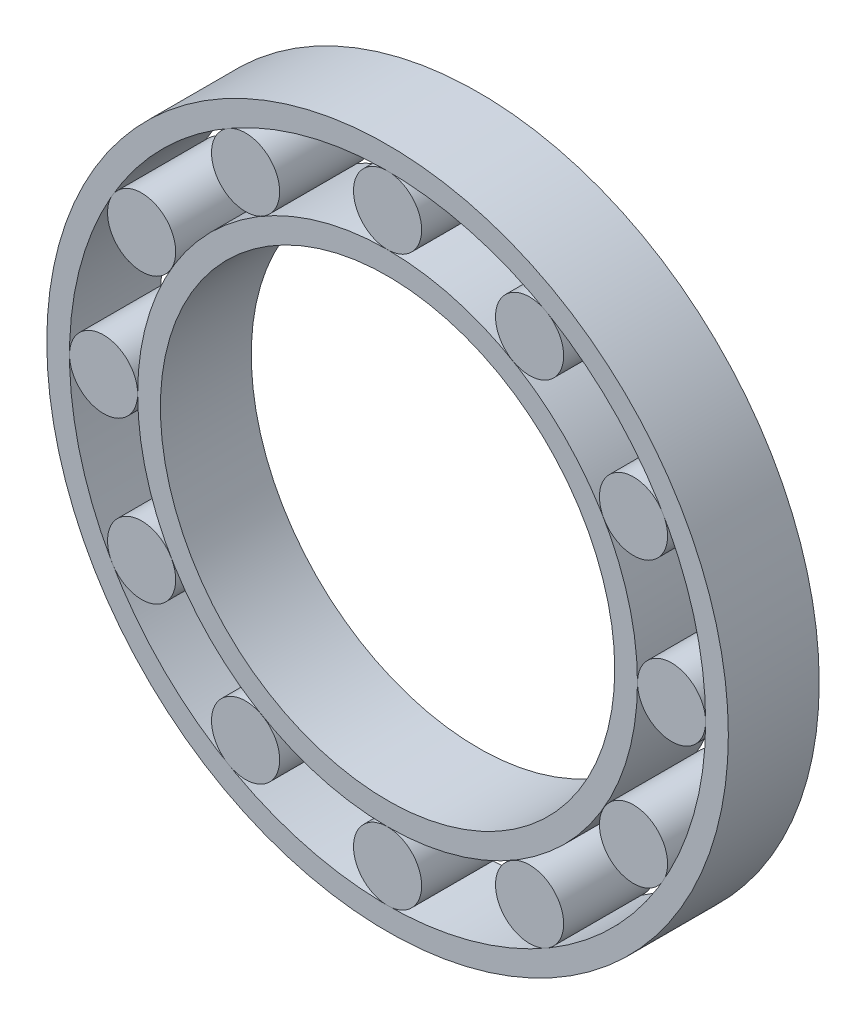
from build123d import *

# Parameters (mm, degrees)
SKETCH1_R              = 9.525
SKETCH1_R_2            = 8.89
BOSS_EXTRUDE1_DEPTH    = 2.54
SKETCH1_R_3            = 6.985
SKETCH1_R_4            = 6.35
BOSS_EXTRUDE1_2_DEPTH  = 2.54
SKETCH2_R              = 0.9525
BOSS_EXTRUDE2_DEPTH    = 2.54
BOSS_EXTRUDE2_2_DEPTH  = 2.54
BOSS_EXTRUDE2_3_DEPTH  = 2.54
BOSS_EXTRUDE2_4_DEPTH  = 2.54
BOSS_EXTRUDE2_5_DEPTH  = 2.54
BOSS_EXTRUDE2_6_DEPTH  = 2.54
BOSS_EXTRUDE2_7_DEPTH  = 2.54
BOSS_EXTRUDE2_8_DEPTH  = 2.54
BOSS_EXTRUDE2_9_DEPTH  = 2.54
BOSS_EXTRUDE2_10_DEPTH = 2.54
BOSS_EXTRUDE2_11_DEPTH = 2.54
BOSS_EXTRUDE2_12_DEPTH = 2.54


with BuildPart() as part:
    # Sketch1 → Boss-Extrude1 (new body)
    with BuildSketch(Plane.XY):
        Circle(SKETCH1_R)
        Circle(SKETCH1_R_2, mode=Mode.SUBTRACT)
    extrude(amount=BOSS_EXTRUDE1_DEPTH)


with BuildPart() as body_2:
    # Sketch1 → Boss-Extrude1 2 (new body)
    with BuildSketch(Plane.XY):
        Circle(SKETCH1_R_3)
        Circle(SKETCH1_R_4, mode=Mode.SUBTRACT)
    extrude(amount=BOSS_EXTRUDE1_2_DEPTH)


with BuildPart() as body_3:
    # Sketch2 → Boss-Extrude2 (new body)
    with BuildSketch(Plane.XY.offset(2.54)):
        with Locations((0, 7.9375)):
            Circle(SKETCH2_R)
    extrude(amount=-BOSS_EXTRUDE2_DEPTH)


with BuildPart() as body_4:
    # Sketch2 → Boss-Extrude2 2 (new body)
    with BuildSketch(Plane.XY.offset(2.54)):
        with Locations((3.96875, 6.874076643)):
            Circle(SKETCH2_R)
    extrude(amount=-BOSS_EXTRUDE2_2_DEPTH)


with BuildPart() as body_5:
    # Sketch2 → Boss-Extrude2 3 (new body)
    with BuildSketch(Plane.XY.offset(2.54)):
        with Locations((6.874076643, 3.96875)):
            Circle(SKETCH2_R)
    extrude(amount=-BOSS_EXTRUDE2_3_DEPTH)


with BuildPart() as body_6:
    # Sketch2 → Boss-Extrude2 4 (new body)
    with BuildSketch(Plane.XY.offset(2.54)):
        with Locations((7.9375, 0)):
            Circle(SKETCH2_R)
    extrude(amount=-BOSS_EXTRUDE2_4_DEPTH)


with BuildPart() as body_7:
    # Sketch2 → Boss-Extrude2 5 (new body)
    with BuildSketch(Plane.XY.offset(2.54)):
        with Locations((6.874076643, -3.96875)):
            Circle(SKETCH2_R)
    extrude(amount=-BOSS_EXTRUDE2_5_DEPTH)


with BuildPart() as body_8:
    # Sketch2 → Boss-Extrude2 6 (new body)
    with BuildSketch(Plane.XY.offset(2.54)):
        with Locations((3.96875, -6.874076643)):
            Circle(SKETCH2_R)
    extrude(amount=-BOSS_EXTRUDE2_6_DEPTH)


with BuildPart() as body_9:
    # Sketch2 → Boss-Extrude2 7 (new body)
    with BuildSketch(Plane.XY.offset(2.54)):
        with Locations((0, -7.9375)):
            Circle(SKETCH2_R)
    extrude(amount=-BOSS_EXTRUDE2_7_DEPTH)


with BuildPart() as body_10:
    # Sketch2 → Boss-Extrude2 8 (new body)
    with BuildSketch(Plane.XY.offset(2.54)):
        with Locations((-3.96875, -6.874076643)):
            Circle(SKETCH2_R)
    extrude(amount=-BOSS_EXTRUDE2_8_DEPTH)


with BuildPart() as body_11:
    # Sketch2 → Boss-Extrude2 9 (new body)
    with BuildSketch(Plane.XY.offset(2.54)):
        with Locations((-6.874076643, -3.96875)):
            Circle(SKETCH2_R)
    extrude(amount=-BOSS_EXTRUDE2_9_DEPTH)


with BuildPart() as body_12:
    # Sketch2 → Boss-Extrude2 10 (new body)
    with BuildSketch(Plane.XY.offset(2.54)):
        with Locations((-7.9375, 0)):
            Circle(SKETCH2_R)
    extrude(amount=-BOSS_EXTRUDE2_10_DEPTH)


with BuildPart() as body_13:
    # Sketch2 → Boss-Extrude2 11 (new body)
    with BuildSketch(Plane.XY.offset(2.54)):
        with Locations((-6.874076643, 3.96875)):
            Circle(SKETCH2_R)
    extrude(amount=-BOSS_EXTRUDE2_11_DEPTH)


with BuildPart() as body_14:
    # Sketch2 → Boss-Extrude2 12 (new body)
    with BuildSketch(Plane.XY.offset(2.54)):
        with Locations((-3.96875, 6.874076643)):
            Circle(SKETCH2_R)
    extrude(amount=-BOSS_EXTRUDE2_12_DEPTH)


solid = Compound([part.part, body_2.part, body_3.part, body_4.part, body_5.part, body_6.part, body_7.part, body_8.part, body_9.part, body_10.part, body_11.part, body_12.part, body_13.part, body_14.part])
